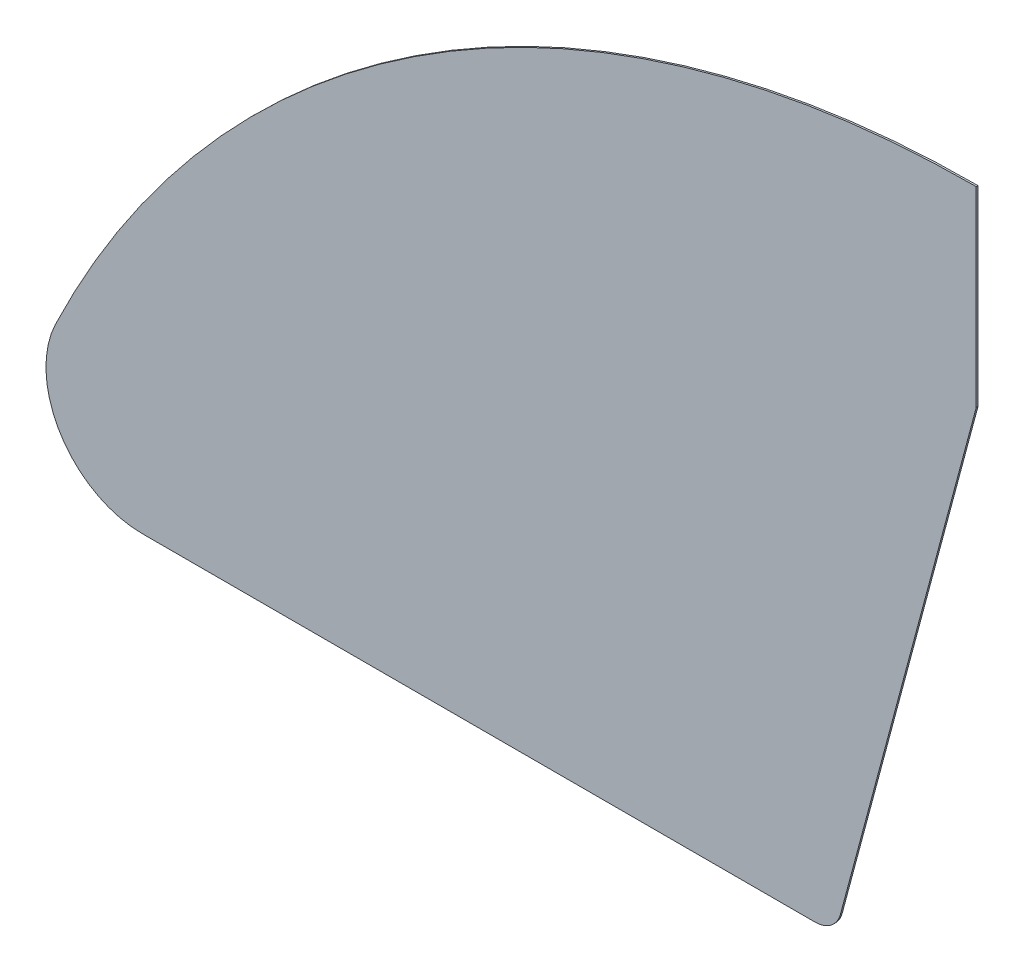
from build123d import *

# Parameters (mm, degrees)
EXTRUSION1_DEPTH = 0.2


with BuildPart() as part:
    # Esquisse1 → Extrusion1 (new body)
    with BuildSketch(Plane.XY):
        with BuildLine():
            Line((1, 1.003940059), (1, -20.858089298))
            Line((1, -20.858089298), (-14.518121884, -78.772508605))
            ThreePointArc((-14.518121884, -78.772508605), (-15.589615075, -80.376111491), (-17.415899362, -80.99605147))
            Line((-17.415899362, -80.99605147), (-94.307241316, -80.99605147))
            ThreePointArc((-94.307241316, -80.99605147), (-103.614933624, -75.85837728), (-104.22810038, -65.24457218))
            ThreePointArc((-104.22810038, -65.24457218), (-61.179618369, -16.926517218), (1, 1.003940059))
        make_face()
    extrude(amount=EXTRUSION1_DEPTH)


solid = part.part
